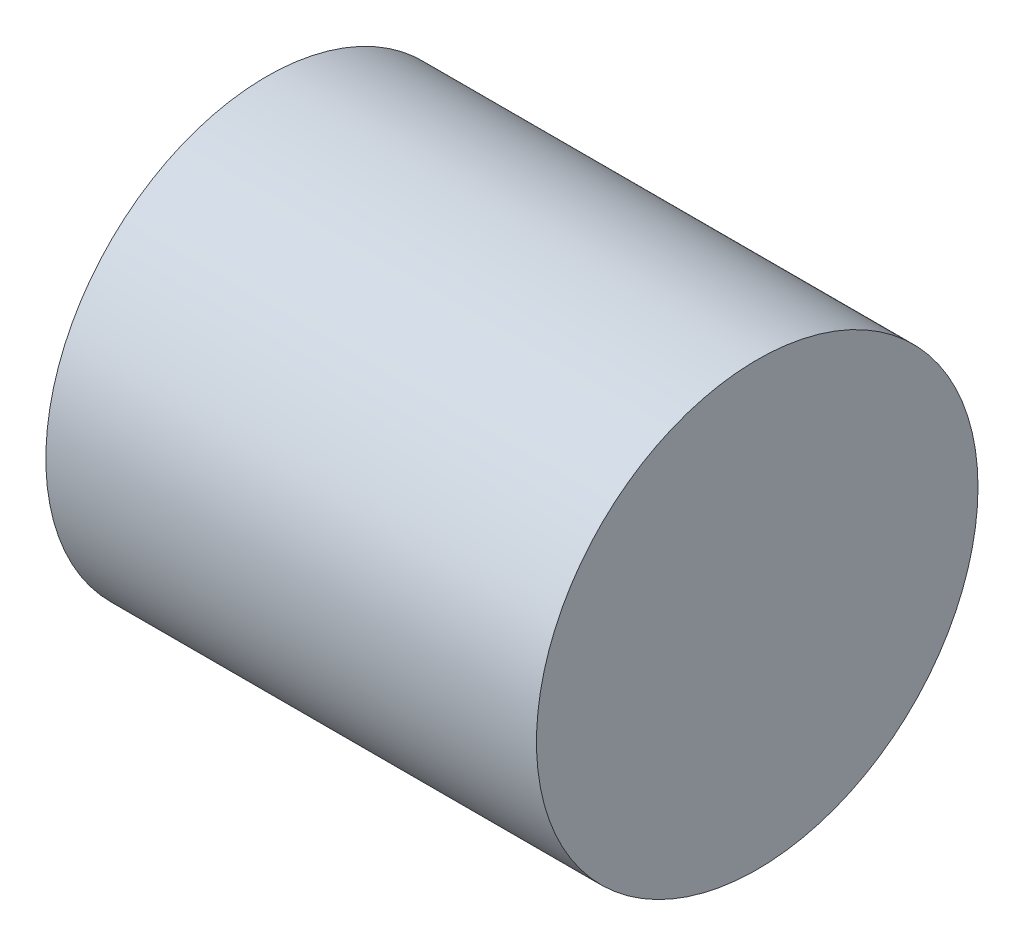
ISO-10303-21;
HEADER;
FILE_DESCRIPTION(('STEP AP214'),'2;1');
FILE_NAME('part.step','',(''),(''),'','','');
FILE_SCHEMA(('AUTOMOTIVE_DESIGN { 1 0 10303 214 1 1 1 1 }'));
ENDSEC;
DATA;
#1=APPLICATION_CONTEXT('core data for automotive mechanical design processes');
#2=APPLICATION_PROTOCOL_DEFINITION('international standard','automotive_design',2000,#1);
#3=PRODUCT_CONTEXT('',#1,'mechanical');
#4=PRODUCT('Part','Part','',(#3));
#5=PRODUCT_RELATED_PRODUCT_CATEGORY('part','',(#4));
#6=PRODUCT_DEFINITION_FORMATION('','',#4);
#7=PRODUCT_DEFINITION_CONTEXT('part definition',#1,'design');
#8=PRODUCT_DEFINITION('design','',#6,#7);
#9=PRODUCT_DEFINITION_SHAPE('','',#8);
#10=(LENGTH_UNIT() NAMED_UNIT(*) SI_UNIT(.MILLI.,.METRE.));
#11=(NAMED_UNIT(*) PLANE_ANGLE_UNIT() SI_UNIT($,.RADIAN.));
#12=(NAMED_UNIT(*) SI_UNIT($,.STERADIAN.) SOLID_ANGLE_UNIT());
#13=UNCERTAINTY_MEASURE_WITH_UNIT(LENGTH_MEASURE(1.E-05),#10,'distance_accuracy_value','');
#14=(GEOMETRIC_REPRESENTATION_CONTEXT(3) GLOBAL_UNCERTAINTY_ASSIGNED_CONTEXT((#13)) GLOBAL_UNIT_ASSIGNED_CONTEXT((#10,
#11,#12)) REPRESENTATION_CONTEXT('',''));
#15=CARTESIAN_POINT('',(0.,0.,0.));
#16=DIRECTION('',(0.,0.,1.));
#17=DIRECTION('',(1.,0.,0.));
#18=AXIS2_PLACEMENT_3D('',#15,#16,#17);
#19=CARTESIAN_POINT('',(20.,0.,0.));
#20=DIRECTION('',(-1.,0.,0.));
#21=DIRECTION('',(0.,0.,1.));
#22=AXIS2_PLACEMENT_3D('',#19,#20,#21);
#23=CYLINDRICAL_SURFACE('',#22,9.);
#24=CARTESIAN_POINT('',(20.,0.,0.));
#25=DIRECTION('',(1.,0.,0.));
#26=DIRECTION('',(0.,0.,-1.));
#27=AXIS2_PLACEMENT_3D('',#24,#25,#26);
#28=CIRCLE('',#27,9.);
#29=CARTESIAN_POINT('',(20.,0.,-9.));
#30=VERTEX_POINT('',#29);
#31=EDGE_CURVE('E10',#30,#30,#28,.T.);
#32=ORIENTED_EDGE('',*,*,#31,.F.);
#33=EDGE_LOOP('',(#32));
#34=FACE_BOUND('',#33,.T.);
#35=CARTESIAN_POINT('',(0.,0.,0.));
#36=DIRECTION('',(1.,0.,0.));
#37=DIRECTION('',(0.,0.,-1.));
#38=AXIS2_PLACEMENT_3D('',#35,#36,#37);
#39=CIRCLE('',#38,9.);
#40=CARTESIAN_POINT('',(0.,0.,-9.));
#41=VERTEX_POINT('',#40);
#42=EDGE_CURVE('E34',#41,#41,#39,.T.);
#43=ORIENTED_EDGE('',*,*,#42,.T.);
#44=EDGE_LOOP('',(#43));
#45=FACE_BOUND('',#44,.T.);
#46=ADVANCED_FACE('F31',(#34,#45),#23,.T.);
#47=CARTESIAN_POINT('',(20.,0.,0.));
#48=DIRECTION('',(1.,0.,0.));
#49=DIRECTION('',(0.,0.,-1.));
#50=AXIS2_PLACEMENT_3D('',#47,#48,#49);
#51=PLANE('',#50);
#52=ORIENTED_EDGE('',*,*,#31,.T.);
#53=EDGE_LOOP('',(#52));
#54=FACE_BOUND('',#53,.T.);
#55=ADVANCED_FACE('F46',(#54),#51,.T.);
#56=CARTESIAN_POINT('',(0.,0.,0.));
#57=DIRECTION('',(1.,0.,0.));
#58=DIRECTION('',(0.,0.,-1.));
#59=AXIS2_PLACEMENT_3D('',#56,#57,#58);
#60=PLANE('',#59);
#61=ORIENTED_EDGE('',*,*,#42,.F.);
#62=EDGE_LOOP('',(#61));
#63=FACE_BOUND('',#62,.T.);
#64=ADVANCED_FACE('F44',(#63),#60,.F.);
#65=CLOSED_SHELL('',(#46,#55,#64));
#66=MANIFOLD_SOLID_BREP('B2',#65);
#67=ADVANCED_BREP_SHAPE_REPRESENTATION('',(#18,#66),#14);
#68=SHAPE_DEFINITION_REPRESENTATION(#9,#67);
ENDSEC;
END-ISO-10303-21;
